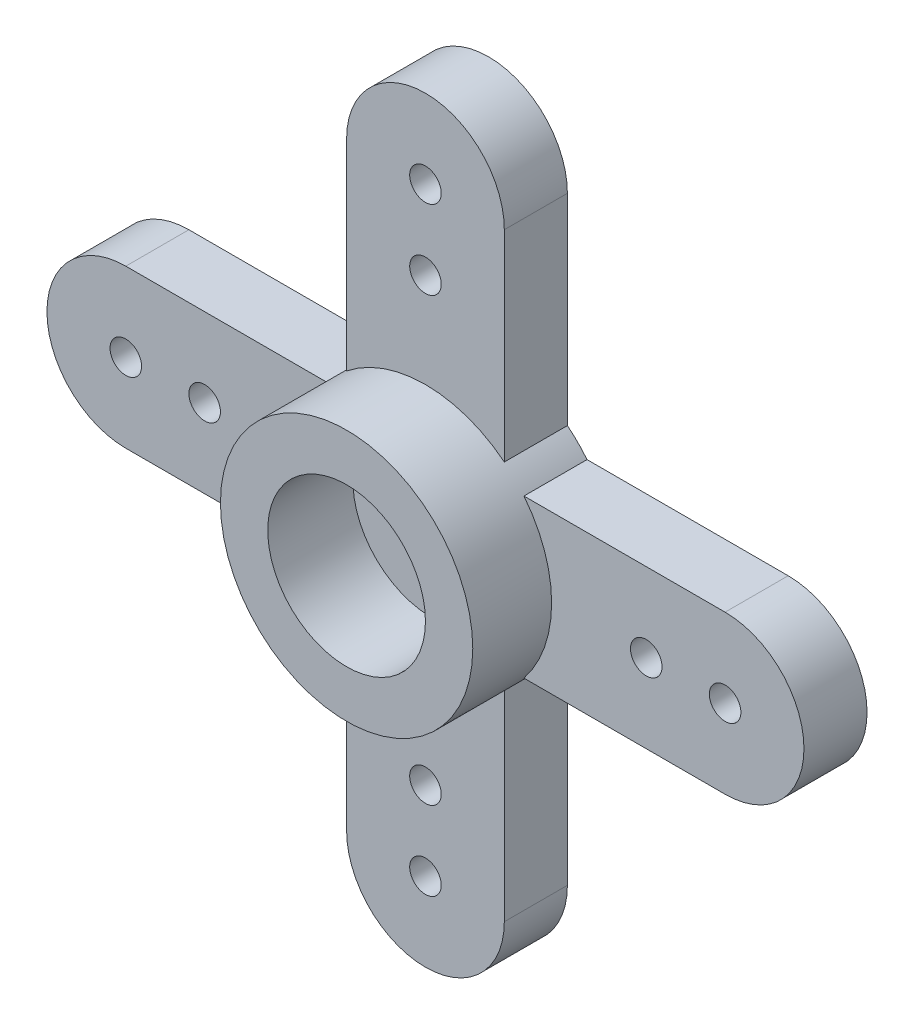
from build123d import *

# Parameters (mm, degrees)
ESQUISSE1_R                  = 0.5
EXTRUSION1_DEPTH             = 2
ESQUISSE3_R                  = 4
EXTRUSION3_DEPTH             = 2.5
EXTRUSION3_DIRECTION_2_REACH = 19.088
ESQUISSE4_R                  = 2.5
EXTRUSION4_DEPTH             = 2.7


with BuildPart() as part:
    # Esquisse1 → Extrusion1 (new body)
    with BuildSketch(Plane.XY):
        with BuildLine():
            Line((-9.5, 2.5), (-2.5, 2.5))
            Line((-2.5, 2.5), (-2.5, 9.5))
            ThreePointArc((-2.5, 9.5), (0, 12), (2.5, 9.5))
            Line((2.5, 9.5), (2.5, 2.5))
            Line((2.5, 2.5), (9.5, 2.5))
            ThreePointArc((9.5, 2.5), (12, 0), (9.5, -2.5))
            Line((9.5, -2.5), (2.5, -2.5))
            Line((2.5, -2.5), (2.5, -9.5))
            ThreePointArc((2.5, -9.5), (0, -12), (-2.5, -9.5))
            Line((-2.5, -9.5), (-2.5, -2.5))
            Line((-2.5, -2.5), (-9.5, -2.5))
            ThreePointArc((-9.5, -2.5), (-12, 0), (-9.5, 2.5))
        make_face()
        with Locations((0, 9.5)):
            Circle(ESQUISSE1_R, mode=Mode.SUBTRACT)
        with Locations((0, 7)):
            Circle(ESQUISSE1_R, mode=Mode.SUBTRACT)
        with Locations((-9.5, 0)):
            Circle(ESQUISSE1_R, mode=Mode.SUBTRACT)
        with Locations((-7, 0)):
            Circle(ESQUISSE1_R, mode=Mode.SUBTRACT)
        with Locations((7, 0)):
            Circle(ESQUISSE1_R, mode=Mode.SUBTRACT)
        with Locations((9.5, 0)):
            Circle(ESQUISSE1_R, mode=Mode.SUBTRACT)
        with Locations((0, -7)):
            Circle(ESQUISSE1_R, mode=Mode.SUBTRACT)
        with Locations((0, -9.5)):
            Circle(ESQUISSE1_R, mode=Mode.SUBTRACT)
    extrude(amount=EXTRUSION1_DEPTH)

    # Esquisse3 → Extrusion3 (add)
    with BuildSketch(Plane.XY.offset(2)):
        Circle(ESQUISSE3_R)
    extrude(amount=EXTRUSION3_DEPTH)

    # Extrusion3 direction 2: up to this face of the body (flat: up to its plane)
    extrusion3_direction_2_end = Plane(part.part.faces().sort_by_distance((0, 0, 0))[0])
    # Esquisse3 → Extrusion3 direction 2 (add, up to the picked face)
    with BuildSketch(Plane.XY.offset(2), mode=Mode.PRIVATE) as extrusion3_direction_2_sk1:
        Circle(ESQUISSE3_R)
    extrusion3_direction_2_tool1 = split(extrude(extrusion3_direction_2_sk1.sketch, amount=-EXTRUSION3_DIRECTION_2_REACH, mode=Mode.PRIVATE), bisect_by=extrusion3_direction_2_end, keep=Keep.BOTH, mode=Mode.PRIVATE)
    add(extrusion3_direction_2_tool1.solids().sort_by(Axis((0, 0, 2), (0, 0, -1)))[0])

    # Esquisse4 → Extrusion4 (cut)
    with BuildSketch(Plane.XY.offset(4.5)):
        Circle(ESQUISSE4_R)
    extrude(amount=-EXTRUSION4_DEPTH, mode=Mode.SUBTRACT)


solid = part.part
